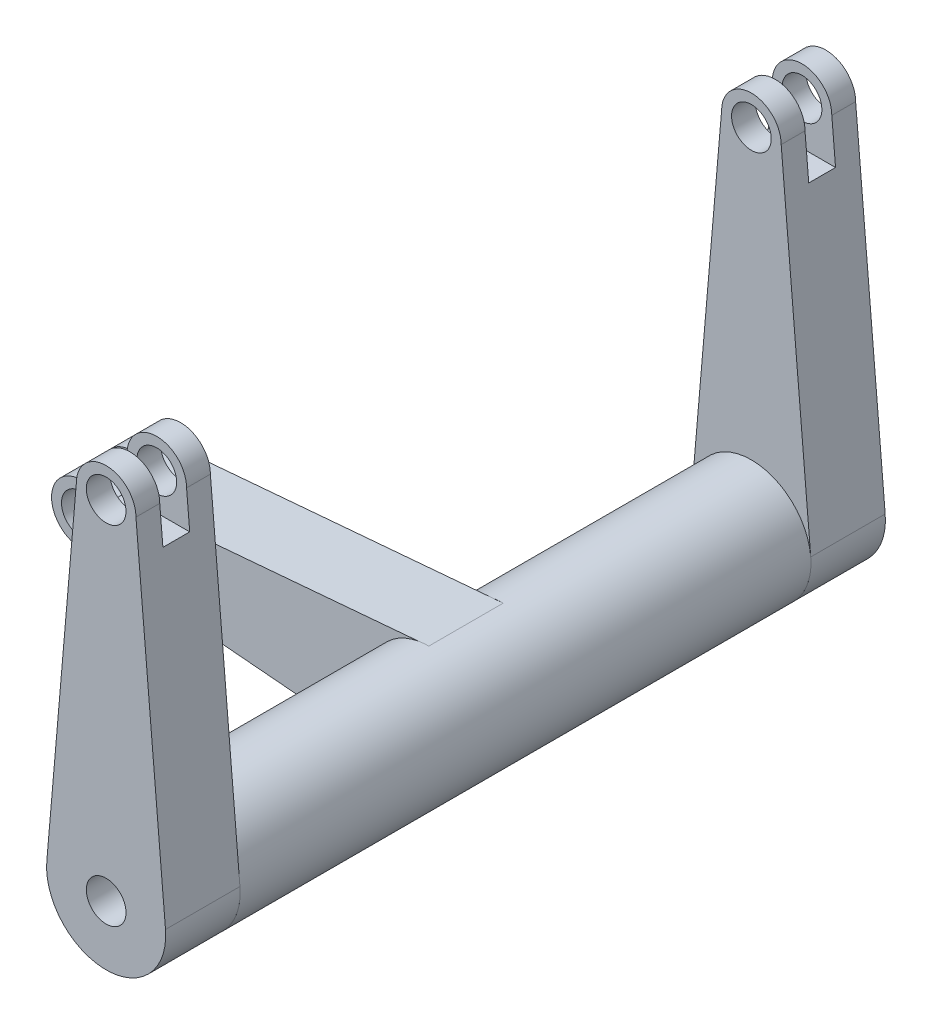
ISO-10303-21;
HEADER;
FILE_DESCRIPTION(('STEP AP214'),'2;1');
FILE_NAME('part.step','',(''),(''),'','','');
FILE_SCHEMA(('AUTOMOTIVE_DESIGN { 1 0 10303 214 1 1 1 1 }'));
ENDSEC;
DATA;
#1=APPLICATION_CONTEXT('core data for automotive mechanical design processes');
#2=APPLICATION_PROTOCOL_DEFINITION('international standard','automotive_design',2000,#1);
#3=PRODUCT_CONTEXT('',#1,'mechanical');
#4=PRODUCT('Part','Part','',(#3));
#5=PRODUCT_RELATED_PRODUCT_CATEGORY('part','',(#4));
#6=PRODUCT_DEFINITION_FORMATION('','',#4);
#7=PRODUCT_DEFINITION_CONTEXT('part definition',#1,'design');
#8=PRODUCT_DEFINITION('design','',#6,#7);
#9=PRODUCT_DEFINITION_SHAPE('','',#8);
#10=(LENGTH_UNIT() NAMED_UNIT(*) SI_UNIT(.MILLI.,.METRE.));
#11=(NAMED_UNIT(*) PLANE_ANGLE_UNIT() SI_UNIT($,.RADIAN.));
#12=(NAMED_UNIT(*) SI_UNIT($,.STERADIAN.) SOLID_ANGLE_UNIT());
#13=UNCERTAINTY_MEASURE_WITH_UNIT(LENGTH_MEASURE(1.E-05),#10,'distance_accuracy_value','');
#14=(GEOMETRIC_REPRESENTATION_CONTEXT(3) GLOBAL_UNCERTAINTY_ASSIGNED_CONTEXT((#13)) GLOBAL_UNIT_ASSIGNED_CONTEXT((#10,
#11,#12)) REPRESENTATION_CONTEXT('',''));
#15=CARTESIAN_POINT('',(0.,0.,0.));
#16=DIRECTION('',(0.,0.,1.));
#17=DIRECTION('',(1.,0.,0.));
#18=AXIS2_PLACEMENT_3D('',#15,#16,#17);
#19=CARTESIAN_POINT('',(88.9,-82.0397739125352,-92.075));
#20=DIRECTION('',(0.,0.,1.));
#21=DIRECTION('',(1.,0.,0.));
#22=AXIS2_PLACEMENT_3D('',#19,#20,#21);
#23=CYLINDRICAL_SURFACE('',#22,7.62);
#24=CARTESIAN_POINT('',(88.9,-82.0397739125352,-79.121));
#25=DIRECTION('',(0.,0.,-1.));
#26=DIRECTION('',(0.,1.,0.));
#27=AXIS2_PLACEMENT_3D('',#24,#25,#26);
#28=CIRCLE('',#27,7.62);
#29=CARTESIAN_POINT('',(81.28,-82.0397739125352,-79.121));
#30=VERTEX_POINT('',#29);
#31=CARTESIAN_POINT('',(96.52,-82.0397739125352,-79.121));
#32=VERTEX_POINT('',#31);
#33=EDGE_CURVE('E246',#30,#32,#28,.T.);
#34=ORIENTED_EDGE('',*,*,#33,.F.);
#35=DIRECTION('',(0.,0.,1.));
#36=VECTOR('',#35,1.);
#37=CARTESIAN_POINT('',(81.28,-82.0397739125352,-92.075));
#38=LINE('',#37,#36);
#39=CARTESIAN_POINT('',(81.28,-82.0397739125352,-73.025));
#40=VERTEX_POINT('',#39);
#41=EDGE_CURVE('E298',#30,#40,#38,.T.);
#42=ORIENTED_EDGE('',*,*,#41,.T.);
#43=CARTESIAN_POINT('',(88.9,-82.0397739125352,-73.025));
#44=DIRECTION('',(0.,0.,-1.));
#45=DIRECTION('',(-1.,0.,0.));
#46=AXIS2_PLACEMENT_3D('',#43,#44,#45);
#47=CIRCLE('',#46,7.62);
#48=CARTESIAN_POINT('',(96.52,-82.0397739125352,-73.025));
#49=VERTEX_POINT('',#48);
#50=EDGE_CURVE('E287',#40,#49,#47,.T.);
#51=ORIENTED_EDGE('',*,*,#50,.T.);
#52=DIRECTION('',(0.,0.,1.));
#53=VECTOR('',#52,1.);
#54=CARTESIAN_POINT('',(96.52,-82.0397739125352,-92.075));
#55=LINE('',#54,#53);
#56=EDGE_CURVE('E320',#32,#49,#55,.T.);
#57=ORIENTED_EDGE('',*,*,#56,.F.);
#58=EDGE_LOOP('',(#34,#42,#51,#57));
#59=FACE_BOUND('',#58,.T.);
#60=ADVANCED_FACE('F33',(#59),#23,.T.);
#61=CARTESIAN_POINT('',(88.9,-82.0397739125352,-85.979));
#62=DIRECTION('',(0.,0.,1.));
#63=DIRECTION('',(0.,-1.,0.));
#64=AXIS2_PLACEMENT_3D('',#61,#62,#63);
#65=CIRCLE('',#64,7.62);
#66=CARTESIAN_POINT('',(96.52,-82.0397739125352,-85.979));
#67=VERTEX_POINT('',#66);
#68=CARTESIAN_POINT('',(81.28,-82.0397739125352,-85.979));
#69=VERTEX_POINT('',#68);
#70=EDGE_CURVE('E48',#67,#69,#65,.T.);
#71=ORIENTED_EDGE('',*,*,#70,.F.);
#72=CARTESIAN_POINT('',(96.52,-82.0397739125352,-92.075));
#73=VERTEX_POINT('',#72);
#74=EDGE_CURVE('E237',#73,#67,#55,.T.);
#75=ORIENTED_EDGE('',*,*,#74,.F.);
#76=CARTESIAN_POINT('',(88.9,-82.0397739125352,-92.075));
#77=DIRECTION('',(0.,0.,-1.));
#78=DIRECTION('',(-1.,0.,0.));
#79=AXIS2_PLACEMENT_3D('',#76,#77,#78);
#80=CIRCLE('',#79,7.62);
#81=CARTESIAN_POINT('',(81.28,-82.0397739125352,-92.075));
#82=VERTEX_POINT('',#81);
#83=EDGE_CURVE('E288',#82,#73,#80,.T.);
#84=ORIENTED_EDGE('',*,*,#83,.F.);
#85=EDGE_CURVE('E311',#82,#69,#38,.T.);
#86=ORIENTED_EDGE('',*,*,#85,.T.);
#87=EDGE_LOOP('',(#71,#75,#84,#86));
#88=FACE_BOUND('',#87,.T.);
#89=ADVANCED_FACE('F596',(#88),#23,.T.);
#90=CARTESIAN_POINT('',(96.52,-82.0397739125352,-92.075));
#91=DIRECTION('',(-0.996292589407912,-0.0860295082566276,0.));
#92=DIRECTION('',(0.0860295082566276,-0.996292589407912,0.));
#93=AXIS2_PLACEMENT_3D('',#90,#91,#92);
#94=PLANE('',#93);
#95=DIRECTION('',(0.0860295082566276,-0.996292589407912,0.));
#96=VECTOR('',#95,1.);
#97=CARTESIAN_POINT('',(96.52,-82.0397739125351,-79.121));
#98=LINE('',#97,#96);
#99=CARTESIAN_POINT('',(97.4756411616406,-93.106885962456,-79.121));
#100=VERTEX_POINT('',#99);
#101=EDGE_CURVE('E228',#32,#100,#98,.T.);
#102=ORIENTED_EDGE('',*,*,#101,.F.);
#103=ORIENTED_EDGE('',*,*,#56,.T.);
#104=DIRECTION('',(0.0860295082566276,-0.996292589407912,0.));
#105=VECTOR('',#104,1.);
#106=CARTESIAN_POINT('',(96.52,-82.0397739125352,-73.025));
#107=LINE('',#106,#105);
#108=CARTESIAN_POINT('',(104.076113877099,-169.545798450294,-73.025));
#109=VERTEX_POINT('',#108);
#110=EDGE_CURVE('E301',#49,#109,#107,.T.);
#111=ORIENTED_EDGE('',*,*,#110,.T.);
#112=CARTESIAN_POINT('',(104.083272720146,-169.628703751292,-73.025));
#113=VERTEX_POINT('',#112);
#114=EDGE_CURVE('E305',#109,#113,#107,.T.);
#115=ORIENTED_EDGE('',*,*,#114,.T.);
#116=DIRECTION('',(0.,0.,1.));
#117=VECTOR('',#116,1.);
#118=CARTESIAN_POINT('',(104.083272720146,-169.628703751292,-92.075));
#119=LINE('',#118,#117);
#120=CARTESIAN_POINT('',(104.083272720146,-169.628703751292,-92.075));
#121=VERTEX_POINT('',#120);
#122=EDGE_CURVE('E317',#121,#113,#119,.T.);
#123=ORIENTED_EDGE('',*,*,#122,.F.);
#124=DIRECTION('',(0.0860295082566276,-0.996292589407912,0.));
#125=VECTOR('',#124,1.);
#126=CARTESIAN_POINT('',(96.52,-82.0397739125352,-92.075));
#127=LINE('',#126,#125);
#128=EDGE_CURVE('E291',#73,#121,#127,.T.);
#129=ORIENTED_EDGE('',*,*,#128,.F.);
#130=ORIENTED_EDGE('',*,*,#74,.T.);
#131=DIRECTION('',(-0.0860295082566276,0.996292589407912,0.));
#132=VECTOR('',#131,1.);
#133=CARTESIAN_POINT('',(96.52,-82.0397739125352,-85.979));
#134=LINE('',#133,#132);
#135=CARTESIAN_POINT('',(97.4756411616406,-93.106885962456,-85.979));
#136=VERTEX_POINT('',#135);
#137=EDGE_CURVE('E231',#136,#67,#134,.T.);
#138=ORIENTED_EDGE('',*,*,#137,.F.);
#139=DIRECTION('',(0.,0.,-1.));
#140=VECTOR('',#139,1.);
#141=CARTESIAN_POINT('',(97.4756411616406,-93.106885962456,-92.075));
#142=LINE('',#141,#140);
#143=EDGE_CURVE('E218',#100,#136,#142,.T.);
#144=ORIENTED_EDGE('',*,*,#143,.F.);
#145=EDGE_LOOP('',(#102,#103,#111,#115,#123,#129,#130,#138,#144));
#146=FACE_BOUND('',#145,.T.);
#147=ADVANCED_FACE('F235',(#146),#94,.F.);
#148=CARTESIAN_POINT('',(73.716727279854,-169.628703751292,-92.075));
#149=DIRECTION('',(0.996292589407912,-0.0860295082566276,0.));
#150=DIRECTION('',(0.0860295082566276,0.996292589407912,0.));
#151=AXIS2_PLACEMENT_3D('',#148,#149,#150);
#152=PLANE('',#151);
#153=DIRECTION('',(0.0860295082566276,0.996292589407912,0.));
#154=VECTOR('',#153,1.);
#155=CARTESIAN_POINT('',(73.716727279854,-169.628703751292,-79.1209999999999));
#156=LINE('',#155,#154);
#157=CARTESIAN_POINT('',(80.3243588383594,-93.106885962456,-79.121));
#158=VERTEX_POINT('',#157);
#159=EDGE_CURVE('E241',#158,#30,#156,.T.);
#160=ORIENTED_EDGE('',*,*,#159,.F.);
#161=DIRECTION('',(0.,0.,1.));
#162=VECTOR('',#161,1.);
#163=CARTESIAN_POINT('',(80.3243588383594,-93.106885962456,-92.075));
#164=LINE('',#163,#162);
#165=CARTESIAN_POINT('',(80.3243588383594,-93.106885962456,-85.979));
#166=VERTEX_POINT('',#165);
#167=EDGE_CURVE('E11',#166,#158,#164,.T.);
#168=ORIENTED_EDGE('',*,*,#167,.F.);
#169=DIRECTION('',(-0.0860295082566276,-0.996292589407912,0.));
#170=VECTOR('',#169,1.);
#171=CARTESIAN_POINT('',(73.716727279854,-169.628703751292,-85.9790000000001));
#172=LINE('',#171,#170);
#173=EDGE_CURVE('E232',#69,#166,#172,.T.);
#174=ORIENTED_EDGE('',*,*,#173,.F.);
#175=ORIENTED_EDGE('',*,*,#85,.F.);
#176=DIRECTION('',(0.0860295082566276,0.996292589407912,0.));
#177=VECTOR('',#176,1.);
#178=CARTESIAN_POINT('',(73.716727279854,-169.628703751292,-92.075));
#179=LINE('',#178,#177);
#180=CARTESIAN_POINT('',(73.716727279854,-169.628703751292,-92.075));
#181=VERTEX_POINT('',#180);
#182=EDGE_CURVE('E296',#181,#82,#179,.T.);
#183=ORIENTED_EDGE('',*,*,#182,.F.);
#184=DIRECTION('',(0.,0.,1.));
#185=VECTOR('',#184,1.);
#186=CARTESIAN_POINT('',(73.716727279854,-169.628703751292,-92.075));
#187=LINE('',#186,#185);
#188=CARTESIAN_POINT('',(73.716727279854,-169.628703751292,-73.025));
#189=VERTEX_POINT('',#188);
#190=EDGE_CURVE('E314',#181,#189,#187,.T.);
#191=ORIENTED_EDGE('',*,*,#190,.T.);
#192=DIRECTION('',(0.0860295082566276,0.996292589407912,0.));
#193=VECTOR('',#192,1.);
#194=CARTESIAN_POINT('',(73.716727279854,-169.628703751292,-73.025));
#195=LINE('',#194,#193);
#196=CARTESIAN_POINT('',(73.7238861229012,-169.545798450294,-73.025));
#197=VERTEX_POINT('',#196);
#198=EDGE_CURVE('E292',#189,#197,#195,.T.);
#199=ORIENTED_EDGE('',*,*,#198,.T.);
#200=EDGE_CURVE('E308',#197,#40,#195,.T.);
#201=ORIENTED_EDGE('',*,*,#200,.T.);
#202=ORIENTED_EDGE('',*,*,#41,.F.);
#203=EDGE_LOOP('',(#160,#168,#174,#175,#183,#191,#199,#201,#202));
#204=FACE_BOUND('',#203,.T.);
#205=ADVANCED_FACE('F571',(#204),#152,.F.);
#206=CARTESIAN_POINT('',(88.9,-82.0397739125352,92.075));
#207=DIRECTION('',(0.,0.,-1.));
#208=DIRECTION('',(-1.,0.,0.));
#209=AXIS2_PLACEMENT_3D('',#206,#207,#208);
#210=CYLINDRICAL_SURFACE('',#209,5.08000000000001);
#211=CARTESIAN_POINT('',(88.9,-82.0397739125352,-73.025));
#212=DIRECTION('',(0.,0.,-1.));
#213=DIRECTION('',(-1.,0.,0.));
#214=AXIS2_PLACEMENT_3D('',#211,#212,#213);
#215=CIRCLE('',#214,5.08000000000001);
#216=CARTESIAN_POINT('',(83.82,-82.0397739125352,-73.025));
#217=VERTEX_POINT('',#216);
#218=EDGE_CURVE('E279',#217,#217,#215,.T.);
#219=ORIENTED_EDGE('',*,*,#218,.F.);
#220=EDGE_LOOP('',(#219));
#221=FACE_BOUND('',#220,.T.);
#222=CARTESIAN_POINT('',(88.9,-82.0397739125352,-79.121));
#223=DIRECTION('',(0.,0.,-1.));
#224=DIRECTION('',(0.,1.,0.));
#225=AXIS2_PLACEMENT_3D('',#222,#223,#224);
#226=CIRCLE('',#225,5.08000000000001);
#227=CARTESIAN_POINT('',(88.9,-76.9597739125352,-79.121));
#228=VERTEX_POINT('',#227);
#229=EDGE_CURVE('E238',#228,#228,#226,.F.);
#230=ORIENTED_EDGE('',*,*,#229,.F.);
#231=EDGE_LOOP('',(#230));
#232=FACE_BOUND('',#231,.T.);
#233=ADVANCED_FACE('F851',(#221,#232),#210,.F.);
#234=CARTESIAN_POINT('',(88.9,-82.0397739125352,-92.075));
#235=DIRECTION('',(0.,0.,-1.));
#236=DIRECTION('',(-1.,0.,0.));
#237=AXIS2_PLACEMENT_3D('',#234,#235,#236);
#238=CIRCLE('',#237,5.08000000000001);
#239=CARTESIAN_POINT('',(83.82,-82.0397739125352,-92.075));
#240=VERTEX_POINT('',#239);
#241=EDGE_CURVE('E273',#240,#240,#238,.T.);
#242=ORIENTED_EDGE('',*,*,#241,.T.);
#243=EDGE_LOOP('',(#242));
#244=FACE_BOUND('',#243,.T.);
#245=CARTESIAN_POINT('',(88.9,-82.0397739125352,-85.979));
#246=DIRECTION('',(0.,0.,1.));
#247=DIRECTION('',(0.,-1.,0.));
#248=AXIS2_PLACEMENT_3D('',#245,#246,#247);
#249=CIRCLE('',#248,5.08000000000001);
#250=CARTESIAN_POINT('',(88.9,-87.1197739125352,-85.979));
#251=VERTEX_POINT('',#250);
#252=EDGE_CURVE('E560',#251,#251,#249,.F.);
#253=ORIENTED_EDGE('',*,*,#252,.F.);
#254=EDGE_LOOP('',(#253));
#255=FACE_BOUND('',#254,.T.);
#256=ADVANCED_FACE('F622',(#244,#255),#210,.F.);
#257=CARTESIAN_POINT('',(88.9,-82.0397739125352,92.075));
#258=DIRECTION('',(0.,0.,-1.));
#259=DIRECTION('',(-1.,0.,0.));
#260=AXIS2_PLACEMENT_3D('',#257,#258,#259);
#261=CYLINDRICAL_SURFACE('',#260,7.62);
#262=CARTESIAN_POINT('',(88.9,-82.0397739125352,85.979));
#263=DIRECTION('',(0.,0.,-1.));
#264=DIRECTION('',(0.,1.,0.));
#265=AXIS2_PLACEMENT_3D('',#262,#263,#264);
#266=CIRCLE('',#265,7.62);
#267=CARTESIAN_POINT('',(81.28,-82.0397739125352,85.979));
#268=VERTEX_POINT('',#267);
#269=CARTESIAN_POINT('',(96.52,-82.0397739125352,85.979));
#270=VERTEX_POINT('',#269);
#271=EDGE_CURVE('E263',#268,#270,#266,.T.);
#272=ORIENTED_EDGE('',*,*,#271,.F.);
#273=DIRECTION('',(0.,0.,-1.));
#274=VECTOR('',#273,1.);
#275=CARTESIAN_POINT('',(81.28,-82.0397739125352,92.075));
#276=LINE('',#275,#274);
#277=CARTESIAN_POINT('',(81.28,-82.0397739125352,92.075));
#278=VERTEX_POINT('',#277);
#279=EDGE_CURVE('E356',#278,#268,#276,.T.);
#280=ORIENTED_EDGE('',*,*,#279,.F.);
#281=CARTESIAN_POINT('',(88.9,-82.0397739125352,92.075));
#282=DIRECTION('',(0.,0.,1.));
#283=DIRECTION('',(1.,0.,0.));
#284=AXIS2_PLACEMENT_3D('',#281,#282,#283);
#285=CIRCLE('',#284,7.62);
#286=CARTESIAN_POINT('',(96.52,-82.0397739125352,92.075));
#287=VERTEX_POINT('',#286);
#288=EDGE_CURVE('E323',#287,#278,#285,.T.);
#289=ORIENTED_EDGE('',*,*,#288,.F.);
#290=DIRECTION('',(0.,0.,-1.));
#291=VECTOR('',#290,1.);
#292=CARTESIAN_POINT('',(96.52,-82.0397739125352,92.075));
#293=LINE('',#292,#291);
#294=EDGE_CURVE('E346',#287,#270,#293,.T.);
#295=ORIENTED_EDGE('',*,*,#294,.T.);
#296=EDGE_LOOP('',(#272,#280,#289,#295));
#297=FACE_BOUND('',#296,.T.);
#298=ADVANCED_FACE('F550',(#297),#261,.T.);
#299=CARTESIAN_POINT('',(88.9,-82.0397739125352,79.121));
#300=DIRECTION('',(0.,0.,1.));
#301=DIRECTION('',(0.,-1.,0.));
#302=AXIS2_PLACEMENT_3D('',#299,#300,#301);
#303=CIRCLE('',#302,7.62);
#304=CARTESIAN_POINT('',(96.52,-82.0397739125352,79.121));
#305=VERTEX_POINT('',#304);
#306=CARTESIAN_POINT('',(81.28,-82.0397739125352,79.121));
#307=VERTEX_POINT('',#306);
#308=EDGE_CURVE('E256',#305,#307,#303,.T.);
#309=ORIENTED_EDGE('',*,*,#308,.F.);
#310=CARTESIAN_POINT('',(96.52,-82.0397739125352,73.025));
#311=VERTEX_POINT('',#310);
#312=EDGE_CURVE('E333',#305,#311,#293,.T.);
#313=ORIENTED_EDGE('',*,*,#312,.T.);
#314=CARTESIAN_POINT('',(88.9,-82.0397739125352,73.025));
#315=DIRECTION('',(0.,0.,1.));
#316=DIRECTION('',(1.,0.,0.));
#317=AXIS2_PLACEMENT_3D('',#314,#315,#316);
#318=CIRCLE('',#317,7.62);
#319=CARTESIAN_POINT('',(81.28,-82.0397739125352,73.025));
#320=VERTEX_POINT('',#319);
#321=EDGE_CURVE('E322',#311,#320,#318,.T.);
#322=ORIENTED_EDGE('',*,*,#321,.T.);
#323=EDGE_CURVE('E355',#307,#320,#276,.T.);
#324=ORIENTED_EDGE('',*,*,#323,.F.);
#325=EDGE_LOOP('',(#309,#313,#322,#324));
#326=FACE_BOUND('',#325,.T.);
#327=ADVANCED_FACE('F531',(#326),#261,.T.);
#328=CARTESIAN_POINT('',(81.28,-82.0397739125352,92.075));
#329=DIRECTION('',(0.996292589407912,-0.0860295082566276,0.));
#330=DIRECTION('',(0.0860295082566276,0.996292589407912,0.));
#331=AXIS2_PLACEMENT_3D('',#328,#329,#330);
#332=PLANE('',#331);
#333=DIRECTION('',(0.0860295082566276,0.996292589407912,0.));
#334=VECTOR('',#333,1.);
#335=CARTESIAN_POINT('',(81.28,-82.0397739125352,85.979));
#336=LINE('',#335,#334);
#337=CARTESIAN_POINT('',(80.4738172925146,-91.3760339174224,85.979));
#338=VERTEX_POINT('',#337);
#339=EDGE_CURVE('E265',#338,#268,#336,.T.);
#340=ORIENTED_EDGE('',*,*,#339,.F.);
#341=DIRECTION('',(0.,0.,1.));
#342=VECTOR('',#341,1.);
#343=CARTESIAN_POINT('',(80.4738172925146,-91.3760339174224,92.075));
#344=LINE('',#343,#342);
#345=CARTESIAN_POINT('',(80.4738172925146,-91.3760339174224,79.121));
#346=VERTEX_POINT('',#345);
#347=EDGE_CURVE('E267',#346,#338,#344,.T.);
#348=ORIENTED_EDGE('',*,*,#347,.F.);
#349=DIRECTION('',(-0.0860295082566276,-0.996292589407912,0.));
#350=VECTOR('',#349,1.);
#351=CARTESIAN_POINT('',(81.28,-82.0397739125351,79.121));
#352=LINE('',#351,#350);
#353=EDGE_CURVE('E258',#307,#346,#352,.T.);
#354=ORIENTED_EDGE('',*,*,#353,.F.);
#355=ORIENTED_EDGE('',*,*,#323,.T.);
#356=DIRECTION('',(-0.0860295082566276,-0.996292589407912,0.));
#357=VECTOR('',#356,1.);
#358=CARTESIAN_POINT('',(81.28,-82.0397739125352,73.025));
#359=LINE('',#358,#357);
#360=CARTESIAN_POINT('',(73.7238861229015,-169.545798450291,73.025));
#361=VERTEX_POINT('',#360);
#362=EDGE_CURVE('E336',#320,#361,#359,.T.);
#363=ORIENTED_EDGE('',*,*,#362,.T.);
#364=CARTESIAN_POINT('',(73.716727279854,-169.628703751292,73.025));
#365=VERTEX_POINT('',#364);
#366=EDGE_CURVE('E340',#361,#365,#359,.T.);
#367=ORIENTED_EDGE('',*,*,#366,.T.);
#368=DIRECTION('',(0.,0.,-1.));
#369=VECTOR('',#368,1.);
#370=CARTESIAN_POINT('',(73.716727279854,-169.628703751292,92.075));
#371=LINE('',#370,#369);
#372=CARTESIAN_POINT('',(73.716727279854,-169.628703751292,92.075));
#373=VERTEX_POINT('',#372);
#374=EDGE_CURVE('E352',#373,#365,#371,.T.);
#375=ORIENTED_EDGE('',*,*,#374,.F.);
#376=DIRECTION('',(-0.0860295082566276,-0.996292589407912,0.));
#377=VECTOR('',#376,1.);
#378=CARTESIAN_POINT('',(81.28,-82.0397739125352,92.075));
#379=LINE('',#378,#377);
#380=EDGE_CURVE('E326',#278,#373,#379,.T.);
#381=ORIENTED_EDGE('',*,*,#380,.F.);
#382=ORIENTED_EDGE('',*,*,#279,.T.);
#383=EDGE_LOOP('',(#340,#348,#354,#355,#363,#367,#375,#381,#382));
#384=FACE_BOUND('',#383,.T.);
#385=ADVANCED_FACE('F524',(#384),#332,.F.);
#386=CARTESIAN_POINT('',(104.083272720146,-169.628703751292,92.075));
#387=DIRECTION('',(-0.996292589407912,-0.0860295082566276,0.));
#388=DIRECTION('',(0.0860295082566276,-0.996292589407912,0.));
#389=AXIS2_PLACEMENT_3D('',#386,#387,#388);
#390=PLANE('',#389);
#391=DIRECTION('',(0.0860295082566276,-0.996292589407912,0.));
#392=VECTOR('',#391,1.);
#393=CARTESIAN_POINT('',(104.083272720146,-169.628703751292,85.979));
#394=LINE('',#393,#392);
#395=CARTESIAN_POINT('',(97.3261827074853,-91.3760339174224,85.979));
#396=VERTEX_POINT('',#395);
#397=EDGE_CURVE('E261',#270,#396,#394,.T.);
#398=ORIENTED_EDGE('',*,*,#397,.F.);
#399=ORIENTED_EDGE('',*,*,#294,.F.);
#400=DIRECTION('',(-0.0860295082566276,0.996292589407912,0.));
#401=VECTOR('',#400,1.);
#402=CARTESIAN_POINT('',(104.083272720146,-169.628703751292,92.075));
#403=LINE('',#402,#401);
#404=CARTESIAN_POINT('',(104.083272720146,-169.628703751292,92.075));
#405=VERTEX_POINT('',#404);
#406=EDGE_CURVE('E331',#405,#287,#403,.T.);
#407=ORIENTED_EDGE('',*,*,#406,.F.);
#408=DIRECTION('',(0.,0.,-1.));
#409=VECTOR('',#408,1.);
#410=CARTESIAN_POINT('',(104.083272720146,-169.628703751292,92.075));
#411=LINE('',#410,#409);
#412=CARTESIAN_POINT('',(104.083272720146,-169.628703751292,73.025));
#413=VERTEX_POINT('',#412);
#414=EDGE_CURVE('E349',#405,#413,#411,.T.);
#415=ORIENTED_EDGE('',*,*,#414,.T.);
#416=DIRECTION('',(-0.0860295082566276,0.996292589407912,0.));
#417=VECTOR('',#416,1.);
#418=CARTESIAN_POINT('',(104.083272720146,-169.628703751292,73.025));
#419=LINE('',#418,#417);
#420=CARTESIAN_POINT('',(104.076113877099,-169.545798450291,73.025));
#421=VERTEX_POINT('',#420);
#422=EDGE_CURVE('E327',#413,#421,#419,.T.);
#423=ORIENTED_EDGE('',*,*,#422,.T.);
#424=EDGE_CURVE('E343',#421,#311,#419,.T.);
#425=ORIENTED_EDGE('',*,*,#424,.T.);
#426=ORIENTED_EDGE('',*,*,#312,.F.);
#427=DIRECTION('',(-0.0860295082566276,0.996292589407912,0.));
#428=VECTOR('',#427,1.);
#429=CARTESIAN_POINT('',(104.083272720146,-169.628703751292,79.1209999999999));
#430=LINE('',#429,#428);
#431=CARTESIAN_POINT('',(97.3261827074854,-91.3760339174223,79.121));
#432=VERTEX_POINT('',#431);
#433=EDGE_CURVE('E254',#432,#305,#430,.T.);
#434=ORIENTED_EDGE('',*,*,#433,.F.);
#435=DIRECTION('',(0.,0.,-1.));
#436=VECTOR('',#435,1.);
#437=CARTESIAN_POINT('',(97.3261827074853,-91.3760339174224,92.075));
#438=LINE('',#437,#436);
#439=EDGE_CURVE('E41',#396,#432,#438,.T.);
#440=ORIENTED_EDGE('',*,*,#439,.F.);
#441=EDGE_LOOP('',(#398,#399,#407,#415,#423,#425,#426,#434,#440));
#442=FACE_BOUND('',#441,.T.);
#443=ADVANCED_FACE('F536',(#442),#390,.F.);
#444=CARTESIAN_POINT('',(88.9,-82.0397739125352,92.075));
#445=DIRECTION('',(0.,0.,-1.));
#446=DIRECTION('',(-1.,0.,0.));
#447=AXIS2_PLACEMENT_3D('',#444,#445,#446);
#448=CIRCLE('',#447,5.08000000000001);
#449=CARTESIAN_POINT('',(83.82,-82.0397739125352,92.075));
#450=VERTEX_POINT('',#449);
#451=EDGE_CURVE('E276',#450,#450,#448,.T.);
#452=ORIENTED_EDGE('',*,*,#451,.F.);
#453=EDGE_LOOP('',(#452));
#454=FACE_BOUND('',#453,.T.);
#455=CARTESIAN_POINT('',(88.9,-82.0397739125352,85.979));
#456=DIRECTION('',(0.,0.,-1.));
#457=DIRECTION('',(0.,1.,0.));
#458=AXIS2_PLACEMENT_3D('',#455,#456,#457);
#459=CIRCLE('',#458,5.08000000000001);
#460=CARTESIAN_POINT('',(88.9,-76.9597739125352,85.979));
#461=VERTEX_POINT('',#460);
#462=EDGE_CURVE('E260',#461,#461,#459,.F.);
#463=ORIENTED_EDGE('',*,*,#462,.F.);
#464=EDGE_LOOP('',(#463));
#465=FACE_BOUND('',#464,.T.);
#466=ADVANCED_FACE('F615',(#454,#465),#210,.F.);
#467=CARTESIAN_POINT('',(88.9,-82.0397739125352,73.025));
#468=DIRECTION('',(0.,0.,1.));
#469=DIRECTION('',(1.,0.,0.));
#470=AXIS2_PLACEMENT_3D('',#467,#468,#469);
#471=CIRCLE('',#470,5.08000000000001);
#472=CARTESIAN_POINT('',(93.98,-82.0397739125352,73.025));
#473=VERTEX_POINT('',#472);
#474=EDGE_CURVE('E284',#473,#473,#471,.T.);
#475=ORIENTED_EDGE('',*,*,#474,.F.);
#476=EDGE_LOOP('',(#475));
#477=FACE_BOUND('',#476,.T.);
#478=CARTESIAN_POINT('',(88.9,-82.0397739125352,79.121));
#479=DIRECTION('',(0.,0.,1.));
#480=DIRECTION('',(0.,-1.,0.));
#481=AXIS2_PLACEMENT_3D('',#478,#479,#480);
#482=CIRCLE('',#481,5.08000000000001);
#483=CARTESIAN_POINT('',(88.9,-87.1197739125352,79.121));
#484=VERTEX_POINT('',#483);
#485=EDGE_CURVE('E253',#484,#484,#482,.F.);
#486=ORIENTED_EDGE('',*,*,#485,.F.);
#487=EDGE_LOOP('',(#486));
#488=FACE_BOUND('',#487,.T.);
#489=ADVANCED_FACE('F653',(#477,#488),#210,.F.);
#490=CARTESIAN_POINT('',(88.9,-170.939773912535,-9.525));
#491=DIRECTION('',(0.,0.,1.));
#492=DIRECTION('',(1.,0.,0.));
#493=AXIS2_PLACEMENT_3D('',#490,#491,#492);
#494=PLANE('',#493);
#495=CARTESIAN_POINT('',(0.,-170.939773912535,-9.525));
#496=DIRECTION('',(0.,0.,1.));
#497=DIRECTION('',(1.,0.,0.));
#498=AXIS2_PLACEMENT_3D('',#495,#496,#497);
#499=CIRCLE('',#498,5.08);
#500=CARTESIAN_POINT('',(-5.08,-170.939773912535,-9.525));
#501=VERTEX_POINT('',#500);
#502=EDGE_CURVE('E443',#501,#501,#499,.T.);
#503=ORIENTED_EDGE('',*,*,#502,.T.);
#504=EDGE_LOOP('',(#503));
#505=FACE_BOUND('',#504,.T.);
#506=CARTESIAN_POINT('',(88.9,-170.939773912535,-9.525));
#507=DIRECTION('',(0.,0.,-1.));
#508=DIRECTION('',(-1.,0.,0.));
#509=AXIS2_PLACEMENT_3D('',#506,#507,#508);
#510=CIRCLE('',#509,15.24);
#511=CARTESIAN_POINT('',(86.3064829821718,-185.957472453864,-9.525));
#512=VERTEX_POINT('',#511);
#513=CARTESIAN_POINT('',(86.3064829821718,-155.922075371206,-9.525));
#514=VERTEX_POINT('',#513);
#515=EDGE_CURVE('E370',#512,#514,#510,.T.);
#516=ORIENTED_EDGE('',*,*,#515,.F.);
#517=DIRECTION('',(0.996346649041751,-0.085401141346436,0.));
#518=VECTOR('',#517,1.);
#519=CARTESIAN_POINT('',(0.,-178.559773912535,-9.525));
#520=LINE('',#519,#518);
#521=CARTESIAN_POINT('',(0.,-178.559773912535,-9.525));
#522=VERTEX_POINT('',#521);
#523=EDGE_CURVE('E382',#522,#512,#520,.T.);
#524=ORIENTED_EDGE('',*,*,#523,.F.);
#525=CARTESIAN_POINT('',(0.,-170.939773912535,-9.525));
#526=DIRECTION('',(0.,0.,1.));
#527=DIRECTION('',(1.,0.,0.));
#528=AXIS2_PLACEMENT_3D('',#525,#526,#527);
#529=CIRCLE('',#528,7.61999999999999);
#530=CARTESIAN_POINT('',(0.,-163.319773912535,-9.525));
#531=VERTEX_POINT('',#530);
#532=EDGE_CURVE('E383',#531,#522,#529,.T.);
#533=ORIENTED_EDGE('',*,*,#532,.F.);
#534=DIRECTION('',(-0.996346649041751,-0.085401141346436,0.));
#535=VECTOR('',#534,1.);
#536=CARTESIAN_POINT('',(0.,-163.319773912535,-9.525));
#537=LINE('',#536,#535);
#538=EDGE_CURVE('E447',#514,#531,#537,.T.);
#539=ORIENTED_EDGE('',*,*,#538,.F.);
#540=EDGE_LOOP('',(#516,#524,#533,#539));
#541=FACE_BOUND('',#540,.T.);
#542=ADVANCED_FACE('F479',(#505,#541),#494,.F.);
#543=CARTESIAN_POINT('',(0.,-163.319773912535,9.525));
#544=DIRECTION('',(0.085401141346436,-0.996346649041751,0.));
#545=DIRECTION('',(0.996346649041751,0.085401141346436,0.));
#546=AXIS2_PLACEMENT_3D('',#543,#544,#545);
#547=PLANE('',#546);
#548=DIRECTION('',(-0.996346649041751,-0.085401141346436,0.));
#549=VECTOR('',#548,1.);
#550=CARTESIAN_POINT('',(0.,-163.319773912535,-3.429));
#551=LINE('',#550,#549);
#552=CARTESIAN_POINT('',(6.35,-162.775488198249,-3.429));
#553=VERTEX_POINT('',#552);
#554=CARTESIAN_POINT('',(0.,-163.319773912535,-3.429));
#555=VERTEX_POINT('',#554);
#556=EDGE_CURVE('E438',#553,#555,#551,.T.);
#557=ORIENTED_EDGE('',*,*,#556,.F.);
#558=DIRECTION('',(0.,0.,1.));
#559=VECTOR('',#558,1.);
#560=CARTESIAN_POINT('',(6.35,-162.775488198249,9.525));
#561=LINE('',#560,#559);
#562=CARTESIAN_POINT('',(6.35,-162.775488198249,3.429));
#563=VERTEX_POINT('',#562);
#564=EDGE_CURVE('E440',#553,#563,#561,.T.);
#565=ORIENTED_EDGE('',*,*,#564,.T.);
#566=DIRECTION('',(0.996346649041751,0.085401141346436,0.));
#567=VECTOR('',#566,1.);
#568=CARTESIAN_POINT('',(0.,-163.319773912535,3.429));
#569=LINE('',#568,#567);
#570=CARTESIAN_POINT('',(0.,-163.319773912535,3.429));
#571=VERTEX_POINT('',#570);
#572=EDGE_CURVE('E410',#571,#563,#569,.T.);
#573=ORIENTED_EDGE('',*,*,#572,.F.);
#574=DIRECTION('',(0.,0.,-1.));
#575=VECTOR('',#574,1.);
#576=CARTESIAN_POINT('',(0.,-163.319773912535,9.525));
#577=LINE('',#576,#575);
#578=CARTESIAN_POINT('',(0.,-163.319773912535,9.525));
#579=VERTEX_POINT('',#578);
#580=EDGE_CURVE('E397',#579,#571,#577,.T.);
#581=ORIENTED_EDGE('',*,*,#580,.F.);
#582=DIRECTION('',(-0.996346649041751,-0.085401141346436,0.));
#583=VECTOR('',#582,1.);
#584=CARTESIAN_POINT('',(0.,-163.319773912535,9.525));
#585=LINE('',#584,#583);
#586=CARTESIAN_POINT('',(86.3064829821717,-155.922075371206,9.525));
#587=VERTEX_POINT('',#586);
#588=EDGE_CURVE('E391',#587,#579,#585,.T.);
#589=ORIENTED_EDGE('',*,*,#588,.F.);
#590=CARTESIAN_POINT('',(88.9,-155.699773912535,9.525));
#591=VERTEX_POINT('',#590);
#592=EDGE_CURVE('E452',#591,#587,#585,.T.);
#593=ORIENTED_EDGE('',*,*,#592,.F.);
#594=DIRECTION('',(0.,0.,-1.));
#595=VECTOR('',#594,1.);
#596=CARTESIAN_POINT('',(88.9,-155.699773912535,9.525));
#597=LINE('',#596,#595);
#598=CARTESIAN_POINT('',(88.9,-155.699773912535,-9.525));
#599=VERTEX_POINT('',#598);
#600=EDGE_CURVE('E400',#591,#599,#597,.T.);
#601=ORIENTED_EDGE('',*,*,#600,.T.);
#602=EDGE_CURVE('E384',#599,#514,#537,.T.);
#603=ORIENTED_EDGE('',*,*,#602,.T.);
#604=ORIENTED_EDGE('',*,*,#538,.T.);
#605=EDGE_CURVE('E395',#555,#531,#577,.T.);
#606=ORIENTED_EDGE('',*,*,#605,.F.);
#607=EDGE_LOOP('',(#557,#565,#573,#581,#589,#593,#601,#603,#604,#606));
#608=FACE_BOUND('',#607,.T.);
#609=ADVANCED_FACE('F505',(#608),#547,.F.);
#610=CARTESIAN_POINT('',(0.,-170.939773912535,9.525));
#611=DIRECTION('',(0.,0.,-1.));
#612=DIRECTION('',(-1.,0.,0.));
#613=AXIS2_PLACEMENT_3D('',#610,#611,#612);
#614=CYLINDRICAL_SURFACE('',#613,7.61999999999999);
#615=CARTESIAN_POINT('',(0.,-170.939773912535,-3.429));
#616=DIRECTION('',(0.,0.,1.));
#617=DIRECTION('',(0.,-1.,0.));
#618=AXIS2_PLACEMENT_3D('',#615,#616,#617);
#619=CIRCLE('',#618,7.61999999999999);
#620=CARTESIAN_POINT('',(0.,-178.559773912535,-3.429));
#621=VERTEX_POINT('',#620);
#622=EDGE_CURVE('E436',#555,#621,#619,.T.);
#623=ORIENTED_EDGE('',*,*,#622,.F.);
#624=ORIENTED_EDGE('',*,*,#605,.T.);
#625=ORIENTED_EDGE('',*,*,#532,.T.);
#626=DIRECTION('',(0.,0.,-1.));
#627=VECTOR('',#626,1.);
#628=CARTESIAN_POINT('',(0.,-178.559773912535,9.525));
#629=LINE('',#628,#627);
#630=EDGE_CURVE('E396',#621,#522,#629,.T.);
#631=ORIENTED_EDGE('',*,*,#630,.F.);
#632=EDGE_LOOP('',(#623,#624,#625,#631));
#633=FACE_BOUND('',#632,.T.);
#634=ADVANCED_FACE('F477',(#633),#614,.T.);
#635=CARTESIAN_POINT('',(0.,-170.939773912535,3.429));
#636=DIRECTION('',(0.,0.,-1.));
#637=DIRECTION('',(0.,1.,0.));
#638=AXIS2_PLACEMENT_3D('',#635,#636,#637);
#639=CIRCLE('',#638,7.61999999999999);
#640=CARTESIAN_POINT('',(0.,-178.559773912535,3.429));
#641=VERTEX_POINT('',#640);
#642=EDGE_CURVE('E431',#641,#571,#639,.T.);
#643=ORIENTED_EDGE('',*,*,#642,.F.);
#644=CARTESIAN_POINT('',(0.,-178.559773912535,9.525));
#645=VERTEX_POINT('',#644);
#646=EDGE_CURVE('E392',#645,#641,#629,.T.);
#647=ORIENTED_EDGE('',*,*,#646,.F.);
#648=CARTESIAN_POINT('',(0.,-170.939773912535,9.525));
#649=DIRECTION('',(0.,0.,1.));
#650=DIRECTION('',(1.,0.,0.));
#651=AXIS2_PLACEMENT_3D('',#648,#649,#650);
#652=CIRCLE('',#651,7.61999999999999);
#653=EDGE_CURVE('E453',#579,#645,#652,.T.);
#654=ORIENTED_EDGE('',*,*,#653,.F.);
#655=ORIENTED_EDGE('',*,*,#580,.T.);
#656=EDGE_LOOP('',(#643,#647,#654,#655));
#657=FACE_BOUND('',#656,.T.);
#658=ADVANCED_FACE('F657',(#657),#614,.T.);
#659=CARTESIAN_POINT('',(0.,-178.559773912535,9.525));
#660=DIRECTION('',(0.085401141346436,0.996346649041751,0.));
#661=DIRECTION('',(-0.996346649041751,0.085401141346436,0.));
#662=AXIS2_PLACEMENT_3D('',#659,#660,#661);
#663=PLANE('',#662);
#664=DIRECTION('',(0.996346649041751,-0.085401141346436,0.));
#665=VECTOR('',#664,1.);
#666=CARTESIAN_POINT('',(0.,-178.559773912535,-3.429));
#667=LINE('',#666,#665);
#668=CARTESIAN_POINT('',(6.35,-179.104059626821,-3.429));
#669=VERTEX_POINT('',#668);
#670=EDGE_CURVE('E409',#621,#669,#667,.T.);
#671=ORIENTED_EDGE('',*,*,#670,.F.);
#672=ORIENTED_EDGE('',*,*,#630,.T.);
#673=ORIENTED_EDGE('',*,*,#523,.T.);
#674=CARTESIAN_POINT('',(88.9,-186.179773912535,-9.525));
#675=VERTEX_POINT('',#674);
#676=EDGE_CURVE('E378',#512,#675,#520,.T.);
#677=ORIENTED_EDGE('',*,*,#676,.T.);
#678=DIRECTION('',(0.,0.,-1.));
#679=VECTOR('',#678,1.);
#680=CARTESIAN_POINT('',(88.9,-186.179773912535,9.525));
#681=LINE('',#680,#679);
#682=CARTESIAN_POINT('',(88.9,-186.179773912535,9.525));
#683=VERTEX_POINT('',#682);
#684=EDGE_CURVE('E462',#683,#675,#681,.T.);
#685=ORIENTED_EDGE('',*,*,#684,.F.);
#686=DIRECTION('',(0.996346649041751,-0.085401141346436,0.));
#687=VECTOR('',#686,1.);
#688=CARTESIAN_POINT('',(0.,-178.559773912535,9.525));
#689=LINE('',#688,#687);
#690=CARTESIAN_POINT('',(86.3064829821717,-185.957472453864,9.525));
#691=VERTEX_POINT('',#690);
#692=EDGE_CURVE('E459',#691,#683,#689,.T.);
#693=ORIENTED_EDGE('',*,*,#692,.F.);
#694=EDGE_CURVE('E461',#645,#691,#689,.T.);
#695=ORIENTED_EDGE('',*,*,#694,.F.);
#696=ORIENTED_EDGE('',*,*,#646,.T.);
#697=DIRECTION('',(-0.996346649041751,0.085401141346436,0.));
#698=VECTOR('',#697,1.);
#699=CARTESIAN_POINT('',(0.,-178.559773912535,3.429));
#700=LINE('',#699,#698);
#701=CARTESIAN_POINT('',(6.35,-179.104059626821,3.429));
#702=VERTEX_POINT('',#701);
#703=EDGE_CURVE('E404',#702,#641,#700,.T.);
#704=ORIENTED_EDGE('',*,*,#703,.F.);
#705=DIRECTION('',(0.,0.,-1.));
#706=VECTOR('',#705,1.);
#707=CARTESIAN_POINT('',(6.35,-179.104059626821,9.525));
#708=LINE('',#707,#706);
#709=EDGE_CURVE('E411',#702,#669,#708,.T.);
#710=ORIENTED_EDGE('',*,*,#709,.T.);
#711=EDGE_LOOP('',(#671,#672,#673,#677,#685,#693,#695,#696,#704,#710));
#712=FACE_BOUND('',#711,.T.);
#713=ADVANCED_FACE('F483',(#712),#663,.F.);
#714=CARTESIAN_POINT('',(0.,-170.939773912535,9.525));
#715=DIRECTION('',(0.,0.,-1.));
#716=DIRECTION('',(-1.,0.,0.));
#717=AXIS2_PLACEMENT_3D('',#714,#715,#716);
#718=CYLINDRICAL_SURFACE('',#717,5.08);
#719=CARTESIAN_POINT('',(0.,-170.939773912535,-3.429));
#720=DIRECTION('',(0.,0.,1.));
#721=DIRECTION('',(0.,-1.,0.));
#722=AXIS2_PLACEMENT_3D('',#719,#720,#721);
#723=CIRCLE('',#722,5.08);
#724=CARTESIAN_POINT('',(-5.08,-170.939773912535,-3.429));
#725=VERTEX_POINT('',#724);
#726=EDGE_CURVE('E406',#725,#725,#723,.T.);
#727=CARTESIAN_POINT('',(-5.08,-170.939773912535,-9.525));
#728=CARTESIAN_POINT('',(-5.08,-170.939773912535,-9.4615));
#729=CARTESIAN_POINT('',(-5.08,-170.939773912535,-9.398));
#730=CARTESIAN_POINT('',(-5.08,-170.939773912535,-9.271));
#731=CARTESIAN_POINT('',(-5.08,-170.939773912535,-9.2075));
#732=CARTESIAN_POINT('',(-5.08,-170.939773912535,-9.0805));
#733=CARTESIAN_POINT('',(-5.08,-170.939773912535,-9.017));
#734=CARTESIAN_POINT('',(-5.08,-170.939773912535,-8.89));
#735=CARTESIAN_POINT('',(-5.08,-170.939773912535,-8.8265));
#736=CARTESIAN_POINT('',(-5.08,-170.939773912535,-8.6995));
#737=CARTESIAN_POINT('',(-5.08,-170.939773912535,-8.636));
#738=CARTESIAN_POINT('',(-5.08,-170.939773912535,-8.509));
#739=CARTESIAN_POINT('',(-5.08,-170.939773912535,-8.4455));
#740=CARTESIAN_POINT('',(-5.08,-170.939773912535,-8.3185));
#741=CARTESIAN_POINT('',(-5.08,-170.939773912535,-8.255));
#742=CARTESIAN_POINT('',(-5.08,-170.939773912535,-8.128));
#743=CARTESIAN_POINT('',(-5.08,-170.939773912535,-8.0645));
#744=CARTESIAN_POINT('',(-5.08,-170.939773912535,-7.9375));
#745=CARTESIAN_POINT('',(-5.08,-170.939773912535,-7.874));
#746=CARTESIAN_POINT('',(-5.08,-170.939773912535,-7.747));
#747=CARTESIAN_POINT('',(-5.08,-170.939773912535,-7.6835));
#748=CARTESIAN_POINT('',(-5.08,-170.939773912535,-7.5565));
#749=CARTESIAN_POINT('',(-5.08,-170.939773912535,-7.493));
#750=CARTESIAN_POINT('',(-5.08,-170.939773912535,-7.366));
#751=CARTESIAN_POINT('',(-5.08,-170.939773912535,-7.3025));
#752=CARTESIAN_POINT('',(-5.08,-170.939773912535,-7.1755));
#753=CARTESIAN_POINT('',(-5.08,-170.939773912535,-7.112));
#754=CARTESIAN_POINT('',(-5.08,-170.939773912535,-6.985));
#755=CARTESIAN_POINT('',(-5.08,-170.939773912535,-6.9215));
#756=CARTESIAN_POINT('',(-5.08,-170.939773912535,-6.7945));
#757=CARTESIAN_POINT('',(-5.08,-170.939773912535,-6.731));
#758=CARTESIAN_POINT('',(-5.08,-170.939773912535,-6.604));
#759=CARTESIAN_POINT('',(-5.08,-170.939773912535,-6.5405));
#760=CARTESIAN_POINT('',(-5.08,-170.939773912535,-6.4135));
#761=CARTESIAN_POINT('',(-5.08,-170.939773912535,-6.35));
#762=CARTESIAN_POINT('',(-5.08,-170.939773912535,-6.223));
#763=CARTESIAN_POINT('',(-5.08,-170.939773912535,-6.1595));
#764=CARTESIAN_POINT('',(-5.08,-170.939773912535,-6.0325));
#765=CARTESIAN_POINT('',(-5.08,-170.939773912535,-5.969));
#766=CARTESIAN_POINT('',(-5.08,-170.939773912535,-5.842));
#767=CARTESIAN_POINT('',(-5.08,-170.939773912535,-5.7785));
#768=CARTESIAN_POINT('',(-5.08,-170.939773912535,-5.6515));
#769=CARTESIAN_POINT('',(-5.08,-170.939773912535,-5.588));
#770=CARTESIAN_POINT('',(-5.08,-170.939773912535,-5.461));
#771=CARTESIAN_POINT('',(-5.08,-170.939773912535,-5.3975));
#772=CARTESIAN_POINT('',(-5.08,-170.939773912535,-5.2705));
#773=CARTESIAN_POINT('',(-5.08,-170.939773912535,-5.207));
#774=CARTESIAN_POINT('',(-5.08,-170.939773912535,-5.08));
#775=CARTESIAN_POINT('',(-5.08,-170.939773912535,-5.0165));
#776=CARTESIAN_POINT('',(-5.08,-170.939773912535,-4.8895));
#777=CARTESIAN_POINT('',(-5.08,-170.939773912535,-4.826));
#778=CARTESIAN_POINT('',(-5.08,-170.939773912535,-4.699));
#779=CARTESIAN_POINT('',(-5.08,-170.939773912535,-4.6355));
#780=CARTESIAN_POINT('',(-5.08,-170.939773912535,-4.5085));
#781=CARTESIAN_POINT('',(-5.08,-170.939773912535,-4.445));
#782=CARTESIAN_POINT('',(-5.08,-170.939773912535,-4.318));
#783=CARTESIAN_POINT('',(-5.08,-170.939773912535,-4.2545));
#784=CARTESIAN_POINT('',(-5.08,-170.939773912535,-4.1275));
#785=CARTESIAN_POINT('',(-5.08,-170.939773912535,-4.064));
#786=CARTESIAN_POINT('',(-5.08,-170.939773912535,-3.937));
#787=CARTESIAN_POINT('',(-5.08,-170.939773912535,-3.8735));
#788=CARTESIAN_POINT('',(-5.08,-170.939773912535,-3.7465));
#789=CARTESIAN_POINT('',(-5.08,-170.939773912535,-3.683));
#790=CARTESIAN_POINT('',(-5.08,-170.939773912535,-3.556));
#791=CARTESIAN_POINT('',(-5.08,-170.939773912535,-3.4925));
#792=CARTESIAN_POINT('',(-5.08,-170.939773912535,-3.429));
#793=B_SPLINE_CURVE_WITH_KNOTS('',3,(#727,#728,#729,#730,#731,#732,#733,#734,#735,#736,#737,
#738,#739,#740,#741,#742,#743,#744,#745,#746,#747,#748,#749,#750,#751,#752,#753,#754,#755,#756,
#757,#758,#759,#760,#761,#762,#763,#764,#765,#766,#767,#768,#769,#770,#771,#772,#773,#774,#775,
#776,#777,#778,#779,#780,#781,#782,#783,#784,#785,#786,#787,#788,#789,#790,#791,#792),
.UNSPECIFIED.,.F.,.F.,(4,2,2,2,2,2,2,2,2,2,2,2,2,2,2,2,2,2,2,2,2,2,2,2,2,2,2,2,2,2,2,2,4),(0.,
0.1905,0.380999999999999,0.571499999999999,0.761999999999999,0.952499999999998,1.143,1.3335,
1.524,1.7145,1.905,2.0955,2.286,2.4765,2.667,2.8575,3.048,3.2385,3.429,3.6195,3.81,4.0005,4.191,
4.3815,4.572,4.7625,4.953,5.1435,5.334,5.5245,5.715,5.9055,6.096),.UNSPECIFIED.);
#794=EDGE_CURVE('BSEAM644',#501,#725,#793,.T.);
#795=ORIENTED_EDGE('',*,*,#502,.F.);
#796=ORIENTED_EDGE('',*,*,#726,.T.);
#797=ORIENTED_EDGE('',*,*,#794,.T.);
#798=ORIENTED_EDGE('',*,*,#794,.F.);
#799=EDGE_LOOP('',(#795,#797,#796,#798));
#800=FACE_BOUND('',#799,.T.);
#801=ADVANCED_FACE('F644',(#800),#718,.F.);
#802=CARTESIAN_POINT('',(0.,-170.939773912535,9.525));
#803=DIRECTION('',(0.,0.,1.));
#804=DIRECTION('',(1.,0.,0.));
#805=AXIS2_PLACEMENT_3D('',#802,#803,#804);
#806=CIRCLE('',#805,5.08);
#807=CARTESIAN_POINT('',(-5.08,-170.939773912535,9.525));
#808=VERTEX_POINT('',#807);
#809=EDGE_CURVE('E444',#808,#808,#806,.T.);
#810=CARTESIAN_POINT('',(0.,-170.939773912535,3.429));
#811=DIRECTION('',(0.,0.,-1.));
#812=DIRECTION('',(0.,1.,0.));
#813=AXIS2_PLACEMENT_3D('',#810,#811,#812);
#814=CIRCLE('',#813,5.08);
#815=CARTESIAN_POINT('',(-5.08,-170.939773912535,3.429));
#816=VERTEX_POINT('',#815);
#817=EDGE_CURVE('E401',#816,#816,#814,.T.);
#818=CARTESIAN_POINT('',(-5.08,-170.939773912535,9.525));
#819=CARTESIAN_POINT('',(-5.08,-170.939773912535,9.4615));
#820=CARTESIAN_POINT('',(-5.08,-170.939773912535,9.398));
#821=CARTESIAN_POINT('',(-5.08,-170.939773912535,9.271));
#822=CARTESIAN_POINT('',(-5.08,-170.939773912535,9.2075));
#823=CARTESIAN_POINT('',(-5.08,-170.939773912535,9.0805));
#824=CARTESIAN_POINT('',(-5.08,-170.939773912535,9.017));
#825=CARTESIAN_POINT('',(-5.08,-170.939773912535,8.89));
#826=CARTESIAN_POINT('',(-5.08,-170.939773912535,8.8265));
#827=CARTESIAN_POINT('',(-5.08,-170.939773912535,8.6995));
#828=CARTESIAN_POINT('',(-5.08,-170.939773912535,8.636));
#829=CARTESIAN_POINT('',(-5.08,-170.939773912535,8.509));
#830=CARTESIAN_POINT('',(-5.08,-170.939773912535,8.4455));
#831=CARTESIAN_POINT('',(-5.08,-170.939773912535,8.3185));
#832=CARTESIAN_POINT('',(-5.08,-170.939773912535,8.255));
#833=CARTESIAN_POINT('',(-5.08,-170.939773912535,8.128));
#834=CARTESIAN_POINT('',(-5.08,-170.939773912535,8.0645));
#835=CARTESIAN_POINT('',(-5.08,-170.939773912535,7.9375));
#836=CARTESIAN_POINT('',(-5.08,-170.939773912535,7.874));
#837=CARTESIAN_POINT('',(-5.08,-170.939773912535,7.747));
#838=CARTESIAN_POINT('',(-5.08,-170.939773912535,7.6835));
#839=CARTESIAN_POINT('',(-5.08,-170.939773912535,7.5565));
#840=CARTESIAN_POINT('',(-5.08,-170.939773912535,7.493));
#841=CARTESIAN_POINT('',(-5.08,-170.939773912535,7.366));
#842=CARTESIAN_POINT('',(-5.08,-170.939773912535,7.3025));
#843=CARTESIAN_POINT('',(-5.08,-170.939773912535,7.1755));
#844=CARTESIAN_POINT('',(-5.08,-170.939773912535,7.112));
#845=CARTESIAN_POINT('',(-5.08,-170.939773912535,6.985));
#846=CARTESIAN_POINT('',(-5.08,-170.939773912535,6.9215));
#847=CARTESIAN_POINT('',(-5.08,-170.939773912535,6.7945));
#848=CARTESIAN_POINT('',(-5.08,-170.939773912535,6.731));
#849=CARTESIAN_POINT('',(-5.08,-170.939773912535,6.604));
#850=CARTESIAN_POINT('',(-5.08,-170.939773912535,6.5405));
#851=CARTESIAN_POINT('',(-5.08,-170.939773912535,6.4135));
#852=CARTESIAN_POINT('',(-5.08,-170.939773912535,6.35));
#853=CARTESIAN_POINT('',(-5.08,-170.939773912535,6.223));
#854=CARTESIAN_POINT('',(-5.08,-170.939773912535,6.1595));
#855=CARTESIAN_POINT('',(-5.08,-170.939773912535,6.0325));
#856=CARTESIAN_POINT('',(-5.08,-170.939773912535,5.969));
#857=CARTESIAN_POINT('',(-5.08,-170.939773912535,5.842));
#858=CARTESIAN_POINT('',(-5.08,-170.939773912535,5.7785));
#859=CARTESIAN_POINT('',(-5.08,-170.939773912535,5.6515));
#860=CARTESIAN_POINT('',(-5.08,-170.939773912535,5.588));
#861=CARTESIAN_POINT('',(-5.08,-170.939773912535,5.461));
#862=CARTESIAN_POINT('',(-5.08,-170.939773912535,5.3975));
#863=CARTESIAN_POINT('',(-5.08,-170.939773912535,5.2705));
#864=CARTESIAN_POINT('',(-5.08,-170.939773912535,5.207));
#865=CARTESIAN_POINT('',(-5.08,-170.939773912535,5.08));
#866=CARTESIAN_POINT('',(-5.08,-170.939773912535,5.0165));
#867=CARTESIAN_POINT('',(-5.08,-170.939773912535,4.8895));
#868=CARTESIAN_POINT('',(-5.08,-170.939773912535,4.826));
#869=CARTESIAN_POINT('',(-5.08,-170.939773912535,4.699));
#870=CARTESIAN_POINT('',(-5.08,-170.939773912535,4.6355));
#871=CARTESIAN_POINT('',(-5.08,-170.939773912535,4.5085));
#872=CARTESIAN_POINT('',(-5.08,-170.939773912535,4.445));
#873=CARTESIAN_POINT('',(-5.08,-170.939773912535,4.318));
#874=CARTESIAN_POINT('',(-5.08,-170.939773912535,4.2545));
#875=CARTESIAN_POINT('',(-5.08,-170.939773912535,4.1275));
#876=CARTESIAN_POINT('',(-5.08,-170.939773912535,4.064));
#877=CARTESIAN_POINT('',(-5.08,-170.939773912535,3.937));
#878=CARTESIAN_POINT('',(-5.08,-170.939773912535,3.8735));
#879=CARTESIAN_POINT('',(-5.08,-170.939773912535,3.7465));
#880=CARTESIAN_POINT('',(-5.08,-170.939773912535,3.683));
#881=CARTESIAN_POINT('',(-5.08,-170.939773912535,3.556));
#882=CARTESIAN_POINT('',(-5.08,-170.939773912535,3.4925));
#883=CARTESIAN_POINT('',(-5.08,-170.939773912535,3.429));
#884=B_SPLINE_CURVE_WITH_KNOTS('',3,(#818,#819,#820,#821,#822,#823,#824,#825,#826,#827,#828,
#829,#830,#831,#832,#833,#834,#835,#836,#837,#838,#839,#840,#841,#842,#843,#844,#845,#846,#847,
#848,#849,#850,#851,#852,#853,#854,#855,#856,#857,#858,#859,#860,#861,#862,#863,#864,#865,#866,
#867,#868,#869,#870,#871,#872,#873,#874,#875,#876,#877,#878,#879,#880,#881,#882,#883),
.UNSPECIFIED.,.F.,.F.,(4,2,2,2,2,2,2,2,2,2,2,2,2,2,2,2,2,2,2,2,2,2,2,2,2,2,2,2,2,2,2,2,4),(0.,
0.1905,0.380999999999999,0.571499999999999,0.761999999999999,0.952499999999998,1.143,1.3335,
1.524,1.7145,1.905,2.0955,2.286,2.4765,2.667,2.8575,3.048,3.2385,3.429,3.6195,3.81,4.0005,4.191,
4.3815,4.572,4.7625,4.953,5.1435,5.334,5.5245,5.715,5.9055,6.096),.UNSPECIFIED.);
#885=EDGE_CURVE('BSEAM647',#808,#816,#884,.T.);
#886=ORIENTED_EDGE('',*,*,#809,.T.);
#887=ORIENTED_EDGE('',*,*,#817,.T.);
#888=ORIENTED_EDGE('',*,*,#885,.T.);
#889=ORIENTED_EDGE('',*,*,#885,.F.);
#890=EDGE_LOOP('',(#886,#888,#887,#889));
#891=FACE_BOUND('',#890,.T.);
#892=ADVANCED_FACE('F647',(#891),#718,.F.);
#893=CARTESIAN_POINT('',(88.9,-170.939773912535,9.525));
#894=DIRECTION('',(0.,0.,1.));
#895=DIRECTION('',(1.,0.,0.));
#896=AXIS2_PLACEMENT_3D('',#893,#894,#895);
#897=PLANE('',#896);
#898=CARTESIAN_POINT('',(88.9,-170.939773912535,9.525));
#899=DIRECTION('',(0.,0.,1.));
#900=DIRECTION('',(1.,0.,0.));
#901=AXIS2_PLACEMENT_3D('',#898,#899,#900);
#902=CIRCLE('',#901,15.24);
#903=EDGE_CURVE('E375',#587,#691,#902,.T.);
#904=ORIENTED_EDGE('',*,*,#903,.F.);
#905=ORIENTED_EDGE('',*,*,#588,.T.);
#906=ORIENTED_EDGE('',*,*,#653,.T.);
#907=ORIENTED_EDGE('',*,*,#694,.T.);
#908=EDGE_LOOP('',(#904,#905,#906,#907));
#909=FACE_BOUND('',#908,.T.);
#910=ORIENTED_EDGE('',*,*,#809,.F.);
#911=EDGE_LOOP('',(#910));
#912=FACE_BOUND('',#911,.T.);
#913=ADVANCED_FACE('F500',(#909,#912),#897,.T.);
#914=CARTESIAN_POINT('',(88.9,-170.939773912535,9.525));
#915=DIRECTION('',(0.,0.,-1.));
#916=DIRECTION('',(-1.,0.,0.));
#917=AXIS2_PLACEMENT_3D('',#914,#915,#916);
#918=CYLINDRICAL_SURFACE('',#917,15.24);
#919=ORIENTED_EDGE('',*,*,#684,.T.);
#920=EDGE_CURVE('E359',#675,#512,#510,.T.);
#921=ORIENTED_EDGE('',*,*,#920,.T.);
#922=ORIENTED_EDGE('',*,*,#515,.T.);
#923=EDGE_CURVE('E365',#514,#599,#510,.T.);
#924=ORIENTED_EDGE('',*,*,#923,.T.);
#925=ORIENTED_EDGE('',*,*,#600,.F.);
#926=EDGE_CURVE('E420',#591,#587,#902,.T.);
#927=ORIENTED_EDGE('',*,*,#926,.T.);
#928=ORIENTED_EDGE('',*,*,#903,.T.);
#929=EDGE_CURVE('E363',#691,#683,#902,.T.);
#930=ORIENTED_EDGE('',*,*,#929,.T.);
#931=EDGE_LOOP('',(#919,#921,#922,#924,#925,#927,#928,#930));
#932=FACE_BOUND('',#931,.T.);
#933=CARTESIAN_POINT('',(88.9,-170.939773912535,73.025));
#934=DIRECTION('',(0.,0.,1.));
#935=DIRECTION('',(1.,0.,0.));
#936=AXIS2_PLACEMENT_3D('',#933,#934,#935);
#937=CIRCLE('',#936,15.24);
#938=EDGE_CURVE('E427',#421,#361,#937,.T.);
#939=ORIENTED_EDGE('',*,*,#938,.F.);
#940=EDGE_CURVE('E510',#361,#421,#937,.T.);
#941=ORIENTED_EDGE('',*,*,#940,.F.);
#942=EDGE_LOOP('',(#939,#941));
#943=FACE_BOUND('',#942,.T.);
#944=CARTESIAN_POINT('',(88.9,-170.939773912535,-73.025));
#945=DIRECTION('',(0.,0.,-1.));
#946=DIRECTION('',(-1.,0.,0.));
#947=AXIS2_PLACEMENT_3D('',#944,#945,#946);
#948=CIRCLE('',#947,15.24);
#949=EDGE_CURVE('E360',#197,#109,#948,.T.);
#950=ORIENTED_EDGE('',*,*,#949,.F.);
#951=EDGE_CURVE('E364',#109,#197,#948,.T.);
#952=ORIENTED_EDGE('',*,*,#951,.F.);
#953=EDGE_LOOP('',(#950,#952));
#954=FACE_BOUND('',#953,.T.);
#955=ADVANCED_FACE('F35',(#932,#943,#954),#918,.T.);
#956=CARTESIAN_POINT('',(6.35,-158.057189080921,-3.429));
#957=DIRECTION('',(1.,0.,0.));
#958=DIRECTION('',(0.,0.,-1.));
#959=AXIS2_PLACEMENT_3D('',#956,#957,#958);
#960=PLANE('',#959);
#961=DIRECTION('',(0.,1.,0.));
#962=VECTOR('',#961,1.);
#963=CARTESIAN_POINT('',(6.35,-183.457189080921,-3.429));
#964=LINE('',#963,#962);
#965=EDGE_CURVE('E424',#669,#553,#964,.T.);
#966=ORIENTED_EDGE('',*,*,#965,.F.);
#967=ORIENTED_EDGE('',*,*,#709,.F.);
#968=DIRECTION('',(0.,-1.,0.));
#969=VECTOR('',#968,1.);
#970=CARTESIAN_POINT('',(6.35,-158.057189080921,3.429));
#971=LINE('',#970,#969);
#972=EDGE_CURVE('E405',#563,#702,#971,.T.);
#973=ORIENTED_EDGE('',*,*,#972,.F.);
#974=ORIENTED_EDGE('',*,*,#564,.F.);
#975=EDGE_LOOP('',(#966,#967,#973,#974));
#976=FACE_BOUND('',#975,.T.);
#977=ADVANCED_FACE('F633',(#976),#960,.F.);
#978=CARTESIAN_POINT('',(6.35,-183.457189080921,-3.429));
#979=DIRECTION('',(0.,0.,1.));
#980=DIRECTION('',(0.,-1.,0.));
#981=AXIS2_PLACEMENT_3D('',#978,#979,#980);
#982=PLANE('',#981);
#983=ORIENTED_EDGE('',*,*,#726,.F.);
#984=EDGE_LOOP('',(#983));
#985=FACE_BOUND('',#984,.T.);
#986=ORIENTED_EDGE('',*,*,#556,.T.);
#987=ORIENTED_EDGE('',*,*,#622,.T.);
#988=ORIENTED_EDGE('',*,*,#670,.T.);
#989=ORIENTED_EDGE('',*,*,#965,.T.);
#990=EDGE_LOOP('',(#986,#987,#988,#989));
#991=FACE_BOUND('',#990,.T.);
#992=ADVANCED_FACE('F636',(#985,#991),#982,.T.);
#993=CARTESIAN_POINT('',(6.35,-158.057189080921,3.429));
#994=DIRECTION('',(0.,0.,-1.));
#995=DIRECTION('',(0.,1.,0.));
#996=AXIS2_PLACEMENT_3D('',#993,#994,#995);
#997=PLANE('',#996);
#998=ORIENTED_EDGE('',*,*,#817,.F.);
#999=EDGE_LOOP('',(#998));
#1000=FACE_BOUND('',#999,.T.);
#1001=ORIENTED_EDGE('',*,*,#572,.T.);
#1002=ORIENTED_EDGE('',*,*,#972,.T.);
#1003=ORIENTED_EDGE('',*,*,#703,.T.);
#1004=ORIENTED_EDGE('',*,*,#642,.T.);
#1005=EDGE_LOOP('',(#1001,#1002,#1003,#1004));
#1006=FACE_BOUND('',#1005,.T.);
#1007=ADVANCED_FACE('F632',(#1000,#1006),#997,.T.);
#1008=CARTESIAN_POINT('',(88.9,-170.939773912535,9.525));
#1009=DIRECTION('',(0.,0.,1.));
#1010=DIRECTION('',(1.,0.,0.));
#1011=AXIS2_PLACEMENT_3D('',#1008,#1009,#1010);
#1012=PLANE('',#1011);
#1013=ORIENTED_EDGE('',*,*,#926,.F.);
#1014=ORIENTED_EDGE('',*,*,#592,.T.);
#1015=EDGE_LOOP('',(#1013,#1014));
#1016=FACE_BOUND('',#1015,.T.);
#1017=ADVANCED_FACE('F509',(#1016),#1012,.F.);
#1018=ORIENTED_EDGE('',*,*,#929,.F.);
#1019=ORIENTED_EDGE('',*,*,#692,.T.);
#1020=EDGE_LOOP('',(#1018,#1019));
#1021=FACE_BOUND('',#1020,.T.);
#1022=ADVANCED_FACE('F495',(#1021),#1012,.F.);
#1023=CARTESIAN_POINT('',(88.9,-170.939773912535,73.025));
#1024=DIRECTION('',(0.,0.,1.));
#1025=DIRECTION('',(1.,0.,0.));
#1026=AXIS2_PLACEMENT_3D('',#1023,#1024,#1025);
#1027=PLANE('',#1026);
#1028=ORIENTED_EDGE('',*,*,#422,.F.);
#1029=CARTESIAN_POINT('',(88.9,-170.939773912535,73.025));
#1030=DIRECTION('',(0.,0.,1.));
#1031=DIRECTION('',(1.,0.,0.));
#1032=AXIS2_PLACEMENT_3D('',#1029,#1030,#1031);
#1033=CIRCLE('',#1032,15.2397728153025);
#1034=EDGE_CURVE('E339',#365,#413,#1033,.T.);
#1035=ORIENTED_EDGE('',*,*,#1034,.F.);
#1036=ORIENTED_EDGE('',*,*,#366,.F.);
#1037=ORIENTED_EDGE('',*,*,#940,.T.);
#1038=EDGE_LOOP('',(#1028,#1035,#1036,#1037));
#1039=FACE_BOUND('',#1038,.T.);
#1040=ADVANCED_FACE('F539',(#1039),#1027,.T.);
#1041=CARTESIAN_POINT('',(88.9,-170.939773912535,-9.525));
#1042=DIRECTION('',(0.,0.,-1.));
#1043=DIRECTION('',(-1.,0.,0.));
#1044=AXIS2_PLACEMENT_3D('',#1041,#1042,#1043);
#1045=PLANE('',#1044);
#1046=ORIENTED_EDGE('',*,*,#676,.F.);
#1047=ORIENTED_EDGE('',*,*,#920,.F.);
#1048=EDGE_LOOP('',(#1046,#1047));
#1049=FACE_BOUND('',#1048,.T.);
#1050=ADVANCED_FACE('F488',(#1049),#1045,.F.);
#1051=CARTESIAN_POINT('',(88.9,-170.939773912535,-73.025));
#1052=DIRECTION('',(0.,0.,-1.));
#1053=DIRECTION('',(-1.,0.,0.));
#1054=AXIS2_PLACEMENT_3D('',#1051,#1052,#1053);
#1055=PLANE('',#1054);
#1056=ORIENTED_EDGE('',*,*,#198,.F.);
#1057=CARTESIAN_POINT('',(88.9,-170.939773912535,-73.025));
#1058=DIRECTION('',(0.,0.,-1.));
#1059=DIRECTION('',(-1.,0.,0.));
#1060=AXIS2_PLACEMENT_3D('',#1057,#1058,#1059);
#1061=CIRCLE('',#1060,15.2397728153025);
#1062=EDGE_CURVE('E304',#113,#189,#1061,.T.);
#1063=ORIENTED_EDGE('',*,*,#1062,.F.);
#1064=ORIENTED_EDGE('',*,*,#114,.F.);
#1065=ORIENTED_EDGE('',*,*,#951,.T.);
#1066=EDGE_LOOP('',(#1056,#1063,#1064,#1065));
#1067=FACE_BOUND('',#1066,.T.);
#1068=ADVANCED_FACE('F584',(#1067),#1055,.T.);
#1069=ORIENTED_EDGE('',*,*,#602,.F.);
#1070=ORIENTED_EDGE('',*,*,#923,.F.);
#1071=EDGE_LOOP('',(#1069,#1070));
#1072=FACE_BOUND('',#1071,.T.);
#1073=ADVANCED_FACE('F611',(#1072),#1045,.F.);
#1074=CARTESIAN_POINT('',(88.9,-82.0397739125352,73.025));
#1075=DIRECTION('',(0.,0.,1.));
#1076=DIRECTION('',(1.,0.,0.));
#1077=AXIS2_PLACEMENT_3D('',#1074,#1075,#1076);
#1078=PLANE('',#1077);
#1079=ORIENTED_EDGE('',*,*,#474,.T.);
#1080=EDGE_LOOP('',(#1079));
#1081=FACE_BOUND('',#1080,.T.);
#1082=ORIENTED_EDGE('',*,*,#424,.F.);
#1083=ORIENTED_EDGE('',*,*,#938,.T.);
#1084=ORIENTED_EDGE('',*,*,#362,.F.);
#1085=ORIENTED_EDGE('',*,*,#321,.F.);
#1086=EDGE_LOOP('',(#1082,#1083,#1084,#1085));
#1087=FACE_BOUND('',#1086,.T.);
#1088=ADVANCED_FACE('F518',(#1081,#1087),#1078,.F.);
#1089=CARTESIAN_POINT('',(88.9,-170.939773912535,92.075));
#1090=DIRECTION('',(0.,0.,-1.));
#1091=DIRECTION('',(-1.,0.,0.));
#1092=AXIS2_PLACEMENT_3D('',#1089,#1090,#1091);
#1093=CYLINDRICAL_SURFACE('',#1092,15.2397728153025);
#1094=ORIENTED_EDGE('',*,*,#1034,.T.);
#1095=ORIENTED_EDGE('',*,*,#414,.F.);
#1096=CARTESIAN_POINT('',(88.9,-170.939773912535,92.075));
#1097=DIRECTION('',(0.,0.,1.));
#1098=DIRECTION('',(1.,0.,0.));
#1099=AXIS2_PLACEMENT_3D('',#1096,#1097,#1098);
#1100=CIRCLE('',#1099,15.2397728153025);
#1101=EDGE_CURVE('E329',#373,#405,#1100,.T.);
#1102=ORIENTED_EDGE('',*,*,#1101,.F.);
#1103=ORIENTED_EDGE('',*,*,#374,.T.);
#1104=EDGE_LOOP('',(#1094,#1095,#1102,#1103));
#1105=FACE_BOUND('',#1104,.T.);
#1106=ADVANCED_FACE('F541',(#1105),#1093,.T.);
#1107=CARTESIAN_POINT('',(88.9,-82.0397739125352,92.075));
#1108=DIRECTION('',(0.,0.,1.));
#1109=DIRECTION('',(1.,0.,0.));
#1110=AXIS2_PLACEMENT_3D('',#1107,#1108,#1109);
#1111=PLANE('',#1110);
#1112=CARTESIAN_POINT('',(88.9,-170.939773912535,92.075));
#1113=DIRECTION('',(0.,0.,-1.));
#1114=DIRECTION('',(-1.,0.,0.));
#1115=AXIS2_PLACEMENT_3D('',#1112,#1113,#1114);
#1116=CIRCLE('',#1115,5.08);
#1117=CARTESIAN_POINT('',(83.82,-170.939773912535,92.075));
#1118=VERTEX_POINT('',#1117);
#1119=EDGE_CURVE('E270',#1118,#1118,#1116,.T.);
#1120=ORIENTED_EDGE('',*,*,#1119,.T.);
#1121=EDGE_LOOP('',(#1120));
#1122=FACE_BOUND('',#1121,.T.);
#1123=ORIENTED_EDGE('',*,*,#451,.T.);
#1124=EDGE_LOOP('',(#1123));
#1125=FACE_BOUND('',#1124,.T.);
#1126=ORIENTED_EDGE('',*,*,#288,.T.);
#1127=ORIENTED_EDGE('',*,*,#380,.T.);
#1128=ORIENTED_EDGE('',*,*,#1101,.T.);
#1129=ORIENTED_EDGE('',*,*,#406,.T.);
#1130=EDGE_LOOP('',(#1126,#1127,#1128,#1129));
#1131=FACE_BOUND('',#1130,.T.);
#1132=ADVANCED_FACE('F546',(#1122,#1125,#1131),#1111,.T.);
#1133=CARTESIAN_POINT('',(88.9,-82.0397739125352,-73.025));
#1134=DIRECTION('',(0.,0.,-1.));
#1135=DIRECTION('',(-1.,0.,0.));
#1136=AXIS2_PLACEMENT_3D('',#1133,#1134,#1135);
#1137=PLANE('',#1136);
#1138=ORIENTED_EDGE('',*,*,#218,.T.);
#1139=EDGE_LOOP('',(#1138));
#1140=FACE_BOUND('',#1139,.T.);
#1141=ORIENTED_EDGE('',*,*,#200,.F.);
#1142=ORIENTED_EDGE('',*,*,#949,.T.);
#1143=ORIENTED_EDGE('',*,*,#110,.F.);
#1144=ORIENTED_EDGE('',*,*,#50,.F.);
#1145=EDGE_LOOP('',(#1141,#1142,#1143,#1144));
#1146=FACE_BOUND('',#1145,.T.);
#1147=ADVANCED_FACE('F579',(#1140,#1146),#1137,.F.);
#1148=CARTESIAN_POINT('',(88.9,-170.939773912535,-92.075));
#1149=DIRECTION('',(0.,0.,1.));
#1150=DIRECTION('',(1.,0.,0.));
#1151=AXIS2_PLACEMENT_3D('',#1148,#1149,#1150);
#1152=CYLINDRICAL_SURFACE('',#1151,15.2397728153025);
#1153=ORIENTED_EDGE('',*,*,#1062,.T.);
#1154=ORIENTED_EDGE('',*,*,#190,.F.);
#1155=CARTESIAN_POINT('',(88.9,-170.939773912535,-92.075));
#1156=DIRECTION('',(0.,0.,-1.));
#1157=DIRECTION('',(-1.,0.,0.));
#1158=AXIS2_PLACEMENT_3D('',#1155,#1156,#1157);
#1159=CIRCLE('',#1158,15.2397728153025);
#1160=EDGE_CURVE('E294',#121,#181,#1159,.T.);
#1161=ORIENTED_EDGE('',*,*,#1160,.F.);
#1162=ORIENTED_EDGE('',*,*,#122,.T.);
#1163=EDGE_LOOP('',(#1153,#1154,#1161,#1162));
#1164=FACE_BOUND('',#1163,.T.);
#1165=ADVANCED_FACE('F588',(#1164),#1152,.T.);
#1166=CARTESIAN_POINT('',(88.9,-82.0397739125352,-92.075));
#1167=DIRECTION('',(0.,0.,-1.));
#1168=DIRECTION('',(-1.,0.,0.));
#1169=AXIS2_PLACEMENT_3D('',#1166,#1167,#1168);
#1170=PLANE('',#1169);
#1171=CARTESIAN_POINT('',(88.9,-170.939773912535,-92.075));
#1172=DIRECTION('',(0.,0.,-1.));
#1173=DIRECTION('',(-1.,0.,0.));
#1174=AXIS2_PLACEMENT_3D('',#1171,#1172,#1173);
#1175=CIRCLE('',#1174,5.08);
#1176=CARTESIAN_POINT('',(83.82,-170.939773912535,-92.075));
#1177=VERTEX_POINT('',#1176);
#1178=EDGE_CURVE('E269',#1177,#1177,#1175,.T.);
#1179=ORIENTED_EDGE('',*,*,#1178,.F.);
#1180=EDGE_LOOP('',(#1179));
#1181=FACE_BOUND('',#1180,.T.);
#1182=ORIENTED_EDGE('',*,*,#241,.F.);
#1183=EDGE_LOOP('',(#1182));
#1184=FACE_BOUND('',#1183,.T.);
#1185=ORIENTED_EDGE('',*,*,#83,.T.);
#1186=ORIENTED_EDGE('',*,*,#128,.T.);
#1187=ORIENTED_EDGE('',*,*,#1160,.T.);
#1188=ORIENTED_EDGE('',*,*,#182,.T.);
#1189=EDGE_LOOP('',(#1185,#1186,#1187,#1188));
#1190=FACE_BOUND('',#1189,.T.);
#1191=ADVANCED_FACE('F592',(#1181,#1184,#1190),#1170,.T.);
#1192=CARTESIAN_POINT('',(88.9,-170.939773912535,92.075));
#1193=DIRECTION('',(0.,0.,-1.));
#1194=DIRECTION('',(-1.,0.,0.));
#1195=AXIS2_PLACEMENT_3D('',#1192,#1193,#1194);
#1196=CYLINDRICAL_SURFACE('',#1195,5.08);
#1197=ORIENTED_EDGE('',*,*,#1119,.F.);
#1198=EDGE_LOOP('',(#1197));
#1199=FACE_BOUND('',#1198,.T.);
#1200=ORIENTED_EDGE('',*,*,#1178,.T.);
#1201=EDGE_LOOP('',(#1200));
#1202=FACE_BOUND('',#1201,.T.);
#1203=ADVANCED_FACE('F766',(#1199,#1202),#1196,.F.);
#1204=CARTESIAN_POINT('',(104.14,-91.3760339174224,85.979));
#1205=DIRECTION('',(0.,1.,0.));
#1206=DIRECTION('',(0.,0.,1.));
#1207=AXIS2_PLACEMENT_3D('',#1204,#1205,#1206);
#1208=PLANE('',#1207);
#1209=ORIENTED_EDGE('',*,*,#347,.T.);
#1210=DIRECTION('',(-1.,0.,0.));
#1211=VECTOR('',#1210,1.);
#1212=CARTESIAN_POINT('',(104.14,-91.3760339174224,85.979));
#1213=LINE('',#1212,#1211);
#1214=EDGE_CURVE('E250',#396,#338,#1213,.T.);
#1215=ORIENTED_EDGE('',*,*,#1214,.F.);
#1216=ORIENTED_EDGE('',*,*,#439,.T.);
#1217=DIRECTION('',(-1.,0.,0.));
#1218=VECTOR('',#1217,1.);
#1219=CARTESIAN_POINT('',(104.14,-91.3760339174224,79.121));
#1220=LINE('',#1219,#1218);
#1221=EDGE_CURVE('E56',#432,#346,#1220,.T.);
#1222=ORIENTED_EDGE('',*,*,#1221,.T.);
#1223=EDGE_LOOP('',(#1209,#1215,#1216,#1222));
#1224=FACE_BOUND('',#1223,.T.);
#1225=ADVANCED_FACE('F774',(#1224),#1208,.T.);
#1226=CARTESIAN_POINT('',(104.14,-65.9760339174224,85.979));
#1227=DIRECTION('',(0.,0.,-1.));
#1228=DIRECTION('',(0.,1.,0.));
#1229=AXIS2_PLACEMENT_3D('',#1226,#1227,#1228);
#1230=PLANE('',#1229);
#1231=ORIENTED_EDGE('',*,*,#462,.T.);
#1232=EDGE_LOOP('',(#1231));
#1233=FACE_BOUND('',#1232,.T.);
#1234=ORIENTED_EDGE('',*,*,#339,.T.);
#1235=ORIENTED_EDGE('',*,*,#271,.T.);
#1236=ORIENTED_EDGE('',*,*,#397,.T.);
#1237=ORIENTED_EDGE('',*,*,#1214,.T.);
#1238=EDGE_LOOP('',(#1234,#1235,#1236,#1237));
#1239=FACE_BOUND('',#1238,.T.);
#1240=ADVANCED_FACE('F552',(#1233,#1239),#1230,.T.);
#1241=CARTESIAN_POINT('',(104.14,-65.9760339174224,79.121));
#1242=DIRECTION('',(0.,0.,1.));
#1243=DIRECTION('',(0.,-1.,0.));
#1244=AXIS2_PLACEMENT_3D('',#1241,#1242,#1243);
#1245=PLANE('',#1244);
#1246=ORIENTED_EDGE('',*,*,#485,.T.);
#1247=EDGE_LOOP('',(#1246));
#1248=FACE_BOUND('',#1247,.T.);
#1249=ORIENTED_EDGE('',*,*,#353,.T.);
#1250=ORIENTED_EDGE('',*,*,#1221,.F.);
#1251=ORIENTED_EDGE('',*,*,#433,.T.);
#1252=ORIENTED_EDGE('',*,*,#308,.T.);
#1253=EDGE_LOOP('',(#1249,#1250,#1251,#1252));
#1254=FACE_BOUND('',#1253,.T.);
#1255=ADVANCED_FACE('F790',(#1248,#1254),#1245,.T.);
#1256=CARTESIAN_POINT('',(104.14,-93.106885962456,-79.121));
#1257=DIRECTION('',(0.,1.,0.));
#1258=DIRECTION('',(0.,0.,1.));
#1259=AXIS2_PLACEMENT_3D('',#1256,#1257,#1258);
#1260=PLANE('',#1259);
#1261=ORIENTED_EDGE('',*,*,#143,.T.);
#1262=DIRECTION('',(-1.,0.,0.));
#1263=VECTOR('',#1262,1.);
#1264=CARTESIAN_POINT('',(104.14,-93.106885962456,-85.979));
#1265=LINE('',#1264,#1263);
#1266=EDGE_CURVE('E221',#136,#166,#1265,.T.);
#1267=ORIENTED_EDGE('',*,*,#1266,.T.);
#1268=ORIENTED_EDGE('',*,*,#167,.T.);
#1269=DIRECTION('',(-1.,0.,0.));
#1270=VECTOR('',#1269,1.);
#1271=CARTESIAN_POINT('',(104.14,-93.106885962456,-79.121));
#1272=LINE('',#1271,#1270);
#1273=EDGE_CURVE('E224',#100,#158,#1272,.T.);
#1274=ORIENTED_EDGE('',*,*,#1273,.F.);
#1275=EDGE_LOOP('',(#1261,#1267,#1268,#1274));
#1276=FACE_BOUND('',#1275,.T.);
#1277=ADVANCED_FACE('F220',(#1276),#1260,.T.);
#1278=CARTESIAN_POINT('',(104.14,-67.706885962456,-79.121));
#1279=DIRECTION('',(0.,0.,-1.));
#1280=DIRECTION('',(0.,1.,0.));
#1281=AXIS2_PLACEMENT_3D('',#1278,#1279,#1280);
#1282=PLANE('',#1281);
#1283=ORIENTED_EDGE('',*,*,#229,.T.);
#1284=EDGE_LOOP('',(#1283));
#1285=FACE_BOUND('',#1284,.T.);
#1286=ORIENTED_EDGE('',*,*,#101,.T.);
#1287=ORIENTED_EDGE('',*,*,#1273,.T.);
#1288=ORIENTED_EDGE('',*,*,#159,.T.);
#1289=ORIENTED_EDGE('',*,*,#33,.T.);
#1290=EDGE_LOOP('',(#1286,#1287,#1288,#1289));
#1291=FACE_BOUND('',#1290,.T.);
#1292=ADVANCED_FACE('F567',(#1285,#1291),#1282,.T.);
#1293=CARTESIAN_POINT('',(104.14,-67.706885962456,-85.979));
#1294=DIRECTION('',(0.,0.,1.));
#1295=DIRECTION('',(0.,-1.,0.));
#1296=AXIS2_PLACEMENT_3D('',#1293,#1294,#1295);
#1297=PLANE('',#1296);
#1298=ORIENTED_EDGE('',*,*,#252,.T.);
#1299=EDGE_LOOP('',(#1298));
#1300=FACE_BOUND('',#1299,.T.);
#1301=ORIENTED_EDGE('',*,*,#137,.T.);
#1302=ORIENTED_EDGE('',*,*,#70,.T.);
#1303=ORIENTED_EDGE('',*,*,#173,.T.);
#1304=ORIENTED_EDGE('',*,*,#1266,.F.);
#1305=EDGE_LOOP('',(#1301,#1302,#1303,#1304));
#1306=FACE_BOUND('',#1305,.T.);
#1307=ADVANCED_FACE('F230',(#1300,#1306),#1297,.T.);
#1308=CLOSED_SHELL('',(#60,#89,#147,#205,#233,#256,#298,#327,#385,#443,#466,#489,#542,#609,#634,
#658,#713,#801,#892,#913,#955,#977,#992,#1007,#1017,#1022,#1040,#1050,#1068,#1073,#1088,#1106,
#1132,#1147,#1165,#1191,#1203,#1225,#1240,#1255,#1277,#1292,#1307));
#1309=MANIFOLD_SOLID_BREP('B2',#1308);
#1310=ADVANCED_BREP_SHAPE_REPRESENTATION('',(#18,#1309),#14);
#1311=SHAPE_DEFINITION_REPRESENTATION(#9,#1310);
ENDSEC;
END-ISO-10303-21;
